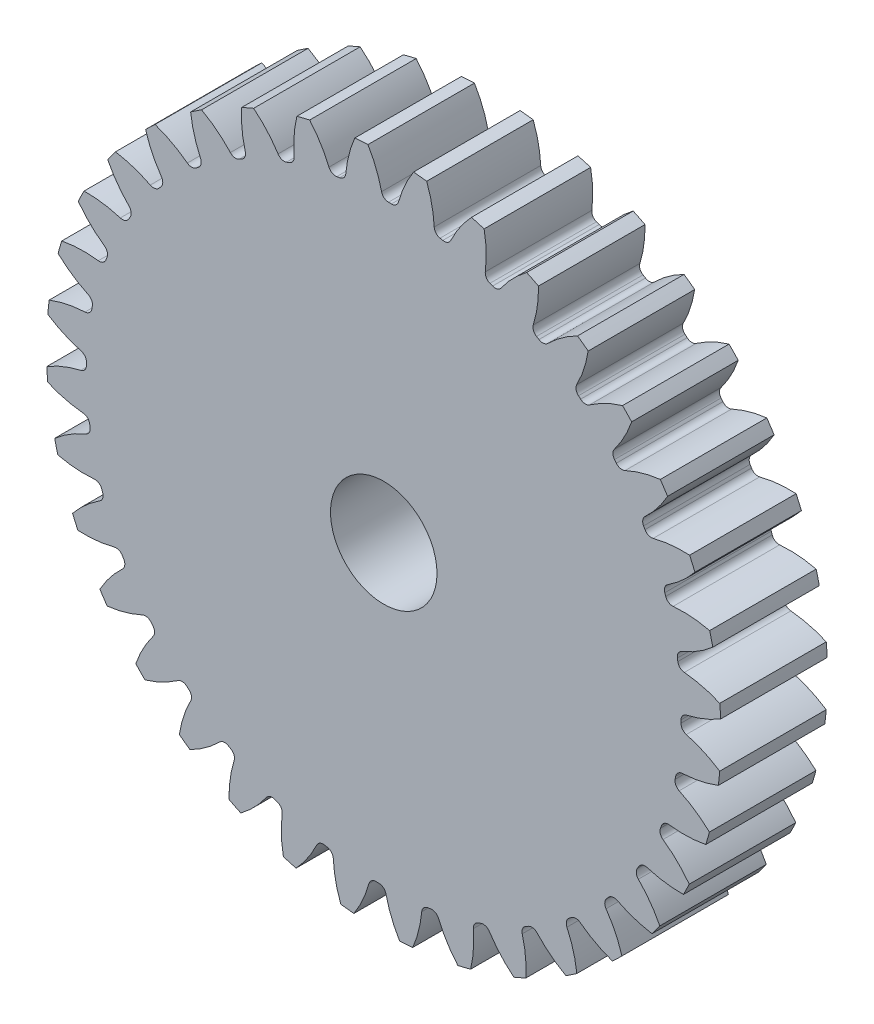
from build123d import *

# Parameters (mm, degrees)
SKETCH3_R         = 321.733333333
GEARBODY_DEPTH    = 101.6
TOOTHCUT_DEPTH    = 467.20514321
CIRPATTERN1_COUNT = 36
BOREDIA_R         = 50.8
BORE_DEPTH        = 12700


with BuildPart() as part:
    # Sketch3 → gearBody (new body)
    with BuildSketch(Plane.XY):
        Circle(SKETCH3_R)
    extrude(amount=GEARBODY_DEPTH)

    # Sketch2 → toothCut (cut, through all)
    with BuildSketch(Plane.XY):
        with BuildLine():
            ThreePointArc((283.540204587, -7.267747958), (283.571968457, -5.899701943), (283.597131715, -4.531518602))
            ThreePointArc((283.597131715, -4.531518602), (285.138034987, -0.297156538), (288.965973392, 2.080046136))
            ThreePointArc((288.965973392, 2.080046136), (305.882996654, 7.371936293), (321.733333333, 15.306456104))
            ThreePointArc((321.733333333, 15.306456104), (322.027543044, -6.699768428), (320.818307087, -28.674713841))
            ThreePointArc((320.818307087, -28.674713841), (305.311697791, -20.087814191), (288.629412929, -14.096891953))
            ThreePointArc((288.629412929, -14.096891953), (284.903659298, -11.562535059), (283.540204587, -7.267747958))
        make_face()
    toothcut = extrude(amount=TOOTHCUT_DEPTH, mode=Mode.SUBTRACT)

    # CirPattern1: toothCut ×36 about axis
    cirpattern1_axis = Axis((0, 0, 0), (0, 0, 1))
    for i in range(1, CIRPATTERN1_COUNT):
        add(toothcut.rotate(cirpattern1_axis, i * 360 / CIRPATTERN1_COUNT), mode=Mode.SUBTRACT)

    # boreDia → bore (cut, symmetric)
    with BuildSketch(Plane.XY):
        Circle(BOREDIA_R)
    extrude(amount=BORE_DEPTH, both=True, mode=Mode.SUBTRACT)


solid = part.part
